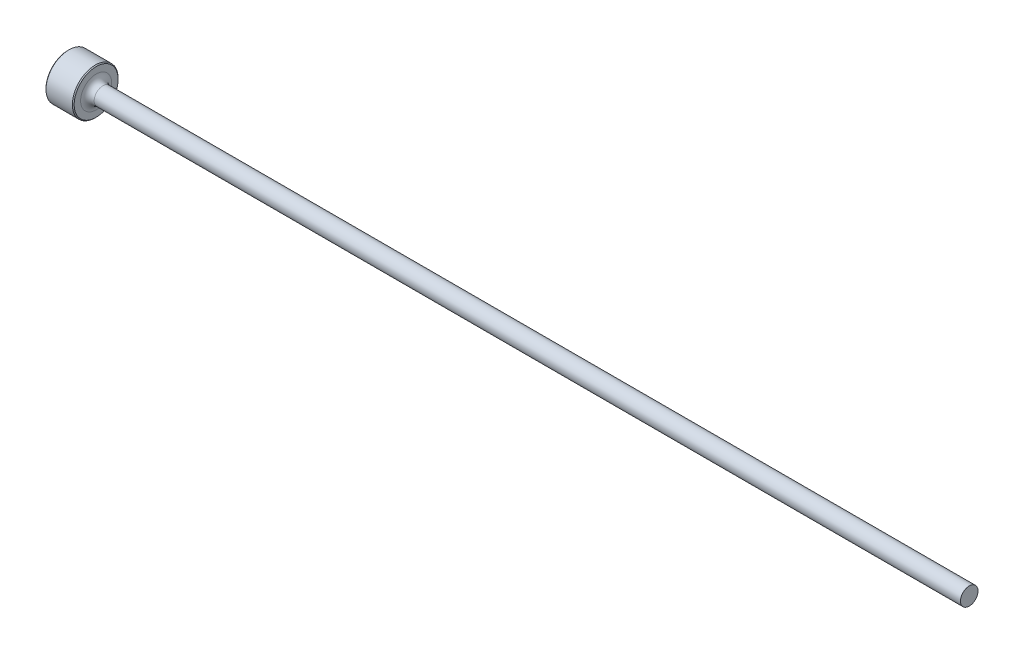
from build123d import *

# Parameters (mm, degrees)
CHAMFER1_SIZE = 0.1016


with BuildPart() as part:
    # Sketch1 → Revolve1 (revolve)
    with BuildSketch(Plane.XY):
        with BuildLine():
            Line((0, 0), (0, 2.5796875))
            Line((0, 2.5796875), (3.175, 2.5796875))
            Line((3.175, 2.5796875), (3.175, 1.7503775))
            ThreePointArc((3.175, 1.7503775), (3.398184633, 1.211562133), (3.937, 0.9883775))
            Line((3.937, 0.9883775), (101.6, 0.9883775))
            Line((101.6, 0.9883775), (101.6, 0))
            Line((101.6, 0), (0, 0))
        make_face()
    revolve(axis=Axis((101.6, 0, 0), (-1, 0, 0)))

    # Chamfer1
    chamfer1_edges = [part.edges().sort_by_distance(p)[0] for p in [
        (0, -2.5796875, 0),
        (3.175, -2.5796875, 0),
    ]]
    chamfer(chamfer1_edges, length=CHAMFER1_SIZE)


solid = part.part
